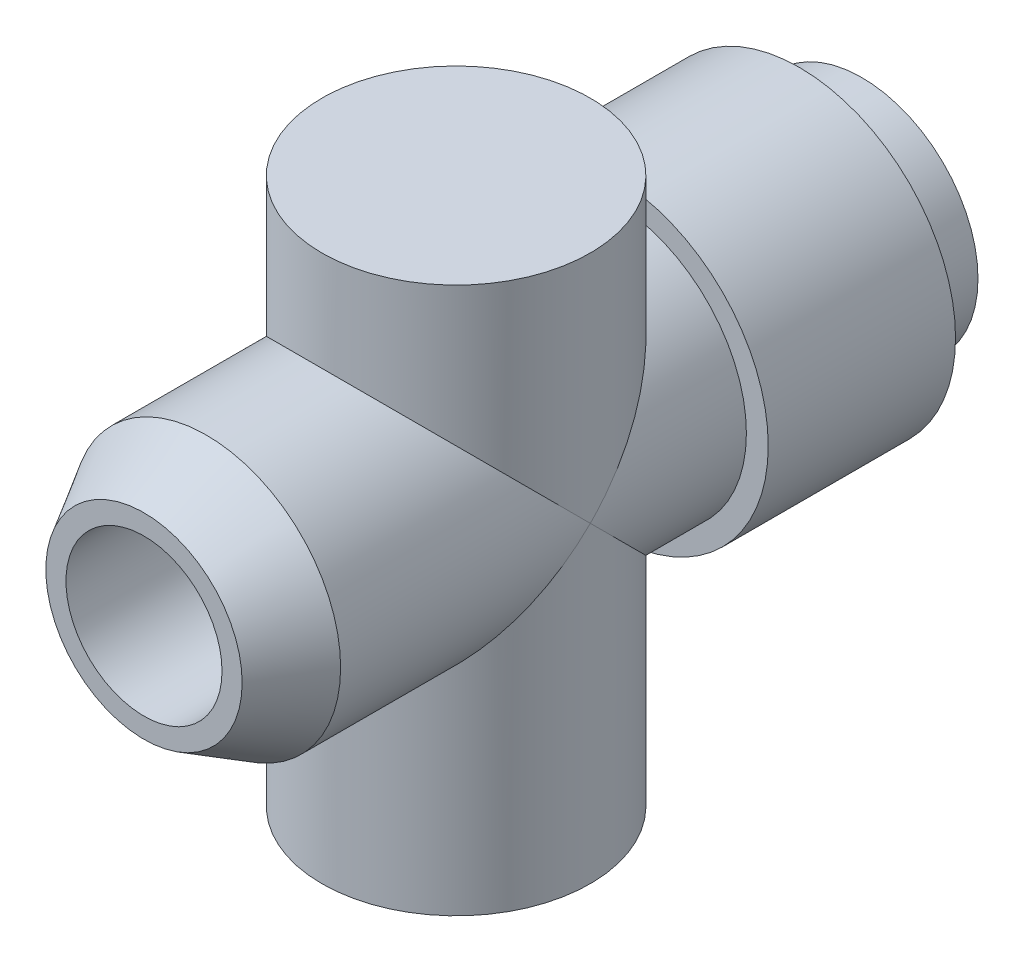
from build123d import *

# Parameters (mm, degrees)
SKETCH1_R           = 4.7244
INSET_DEPTH         = 2.54
SKETCH2_R           = 6.35
BASE_DEPTH          = 7.62
SKETCH3_R           = 5.461
NIB_DEPTH           = 19.05
SKETCH4_R           = 3.175
CUT_EXTRUDE1_DEPTH  = 31.559271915
EXTRUDE1_DEPTH      = 9.525
EXTRUDE1_DEPTH_BACK = 12.7
SKETCH5_R           = 5.461
SKETCH6_R           = 3.175
CUT_EXTRUDE2_DEPTH  = 20.6375
SKETCH7_R           = 3.048
EXTRUDE2_DEPTH      = 1.5875
CHAMFER1_SIZE       = 2.54
CHAMFER1_SIZE2      = 1.466469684


with BuildPart() as part:
    # Sketch1 → inset (new body)
    with BuildSketch(Plane.XY):
        Circle(SKETCH1_R)
    extrude(amount=INSET_DEPTH)

    # Sketch2 → base (add)
    with BuildSketch(Plane.XY.offset(2.54)):
        with Locations(Location((0, 0, 0), (0, 0, 180))):
            Circle(SKETCH2_R)
    extrude(amount=BASE_DEPTH)

    # Sketch3 → nib (add)
    with BuildSketch(Plane.XY.offset(10.16)):
        with Locations(Location((0, 0, 0), (0, 0, 180))):
            Circle(SKETCH3_R)
    extrude(amount=NIB_DEPTH)

    # Sketch4 → Cut-Extrude1 (cut, through all)
    with BuildSketch(Plane.XY.offset(29.21)):
        Circle(SKETCH4_R)
    extrude(amount=-CUT_EXTRUDE1_DEPTH, mode=Mode.SUBTRACT)

    # Sketch5 → Extrude1 (add, two sides: drawn at the far end of the back side and taken through both)
    with BuildSketch(Plane(origin=(0, 0, 0), x_dir=(1, 0, 0), z_dir=(0, 1, 0)).offset(-EXTRUDE1_DEPTH_BACK)):
        with Locations(Location((0, -16.51, 0), (0, 0, 270))):
            Circle(SKETCH5_R)
    extrude(amount=EXTRUDE1_DEPTH + EXTRUDE1_DEPTH_BACK)

    # Sketch6 → Cut-Extrude2 (cut)
    with BuildSketch(Plane.XZ.offset(12.7)):
        with Locations(Location((0, 16.51, 0), (0, 0, 270))):
            Circle(SKETCH6_R)
    extrude(amount=-CUT_EXTRUDE2_DEPTH, mode=Mode.SUBTRACT)

    # Sketch7 → Extrude2 (add)
    with BuildSketch(Plane.XZ.offset(-7.9375)):
        with Locations(Location((0, 16.51, 0), (0, 0, 270))):
            Circle(SKETCH7_R)
    extrude(amount=EXTRUDE2_DEPTH)

    # Chamfer1
    chamfer1_edges = [part.edges().sort_by_distance(p)[0] for p in [
        (5.461, 0, 29.21),
    ]]
    chamfer1_side = [part.faces().sort_by_distance(p)[0] for p in [
        (5.461, 0, 22.86),
    ]]
    chamfer(chamfer1_edges, length=CHAMFER1_SIZE, length2=CHAMFER1_SIZE2, reference=chamfer1_side[0])


solid = part.part
